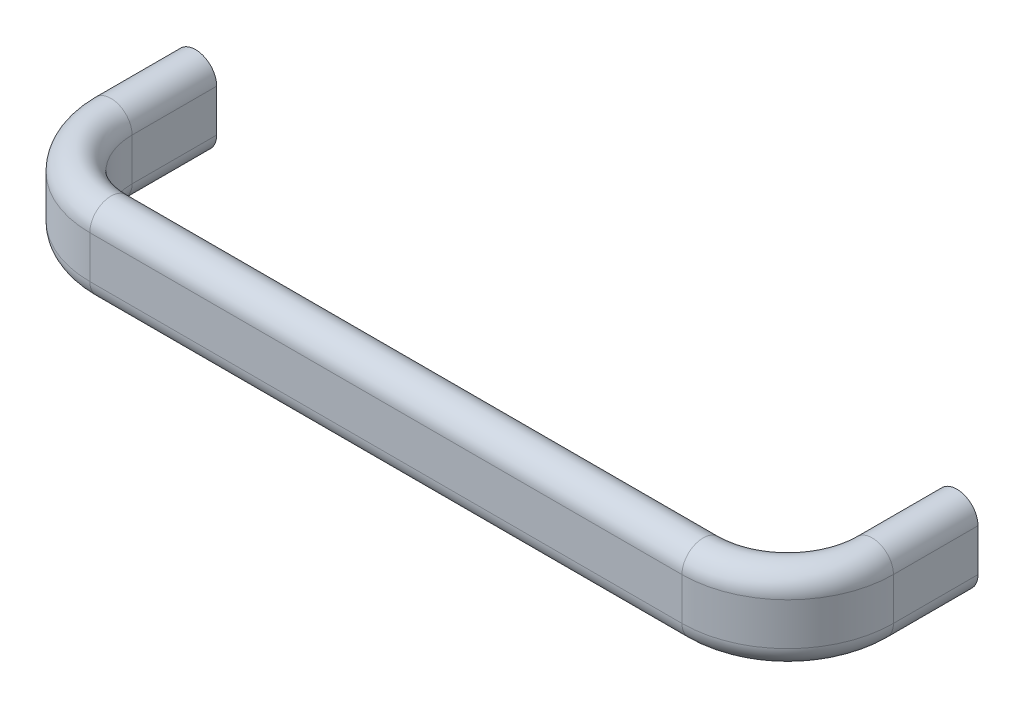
ISO-10303-21;
HEADER;
FILE_DESCRIPTION(('STEP AP214'),'2;1');
FILE_NAME('part.step','',(''),(''),'','','');
FILE_SCHEMA(('AUTOMOTIVE_DESIGN { 1 0 10303 214 1 1 1 1 }'));
ENDSEC;
DATA;
#1=APPLICATION_CONTEXT('core data for automotive mechanical design processes');
#2=APPLICATION_PROTOCOL_DEFINITION('international standard','automotive_design',2000,#1);
#3=PRODUCT_CONTEXT('',#1,'mechanical');
#4=PRODUCT('Part','Part','',(#3));
#5=PRODUCT_RELATED_PRODUCT_CATEGORY('part','',(#4));
#6=PRODUCT_DEFINITION_FORMATION('','',#4);
#7=PRODUCT_DEFINITION_CONTEXT('part definition',#1,'design');
#8=PRODUCT_DEFINITION('design','',#6,#7);
#9=PRODUCT_DEFINITION_SHAPE('','',#8);
#10=(LENGTH_UNIT() NAMED_UNIT(*) SI_UNIT(.MILLI.,.METRE.));
#11=(NAMED_UNIT(*) PLANE_ANGLE_UNIT() SI_UNIT($,.RADIAN.));
#12=(NAMED_UNIT(*) SI_UNIT($,.STERADIAN.) SOLID_ANGLE_UNIT());
#13=UNCERTAINTY_MEASURE_WITH_UNIT(LENGTH_MEASURE(1.E-05),#10,'distance_accuracy_value','');
#14=(GEOMETRIC_REPRESENTATION_CONTEXT(3) GLOBAL_UNCERTAINTY_ASSIGNED_CONTEXT((#13)) GLOBAL_UNIT_ASSIGNED_CONTEXT((#10,
#11,#12)) REPRESENTATION_CONTEXT('',''));
#15=CARTESIAN_POINT('',(0.,0.,0.));
#16=DIRECTION('',(0.,0.,1.));
#17=DIRECTION('',(1.,0.,0.));
#18=AXIS2_PLACEMENT_3D('',#15,#16,#17);
#19=CARTESIAN_POINT('',(-5.,-5.,20.));
#20=DIRECTION('',(-1.,0.,0.));
#21=DIRECTION('',(0.,-1.,0.));
#22=AXIS2_PLACEMENT_3D('',#19,#20,#21);
#23=PLANE('',#22);
#24=DIRECTION('',(0.,1.,0.));
#25=VECTOR('',#24,1.);
#26=CARTESIAN_POINT('',(-5.,-5.,20.));
#27=LINE('',#26,#25);
#28=CARTESIAN_POINT('',(-5.,-5.,20.));
#29=VERTEX_POINT('',#28);
#30=CARTESIAN_POINT('',(-5.,5.,20.));
#31=VERTEX_POINT('',#30);
#32=EDGE_CURVE('E200',#29,#31,#27,.T.);
#33=ORIENTED_EDGE('',*,*,#32,.T.);
#34=DIRECTION('',(0.,0.,-1.));
#35=VECTOR('',#34,1.);
#36=CARTESIAN_POINT('',(-5.,5.,20.));
#37=LINE('',#36,#35);
#38=CARTESIAN_POINT('',(-5.,5.,-1.77089470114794E-13));
#39=VERTEX_POINT('',#38);
#40=EDGE_CURVE('E224',#31,#39,#37,.T.);
#41=ORIENTED_EDGE('',*,*,#40,.T.);
#42=DIRECTION('',(0.,1.,0.));
#43=VECTOR('',#42,1.);
#44=CARTESIAN_POINT('',(-5.,-5.,-1.77089470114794E-13));
#45=LINE('',#44,#43);
#46=CARTESIAN_POINT('',(-5.,-5.,-1.77089470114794E-13));
#47=VERTEX_POINT('',#46);
#48=EDGE_CURVE('E222',#47,#39,#45,.T.);
#49=ORIENTED_EDGE('',*,*,#48,.F.);
#50=DIRECTION('',(0.,0.,-1.));
#51=VECTOR('',#50,1.);
#52=CARTESIAN_POINT('',(-5.,-5.,20.));
#53=LINE('',#52,#51);
#54=EDGE_CURVE('E227',#29,#47,#53,.T.);
#55=ORIENTED_EDGE('',*,*,#54,.F.);
#56=EDGE_LOOP('',(#33,#41,#49,#55));
#57=FACE_BOUND('',#56,.T.);
#58=ADVANCED_FACE('F14',(#57),#23,.T.);
#59=CARTESIAN_POINT('',(0.,5.,20.));
#60=DIRECTION('',(0.,0.,-1.));
#61=DIRECTION('',(0.,-1.,0.));
#62=AXIS2_PLACEMENT_3D('',#59,#60,#61);
#63=CYLINDRICAL_SURFACE('',#62,5.);
#64=CARTESIAN_POINT('',(0.,5.,20.));
#65=DIRECTION('',(0.,0.,-1.));
#66=DIRECTION('',(0.,1.,0.));
#67=AXIS2_PLACEMENT_3D('',#64,#65,#66);
#68=CIRCLE('',#67,5.);
#69=CARTESIAN_POINT('',(5.,5.,20.));
#70=VERTEX_POINT('',#69);
#71=EDGE_CURVE('E213',#31,#70,#68,.T.);
#72=ORIENTED_EDGE('',*,*,#71,.T.);
#73=DIRECTION('',(0.,0.,-1.));
#74=VECTOR('',#73,1.);
#75=CARTESIAN_POINT('',(5.,5.,20.));
#76=LINE('',#75,#74);
#77=CARTESIAN_POINT('',(5.,5.,-2.16878157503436E-13));
#78=VERTEX_POINT('',#77);
#79=EDGE_CURVE('E221',#70,#78,#76,.T.);
#80=ORIENTED_EDGE('',*,*,#79,.T.);
#81=CARTESIAN_POINT('',(0.,5.,-1.96983813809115E-13));
#82=DIRECTION('',(0.,0.,-1.));
#83=DIRECTION('',(0.,1.,0.));
#84=AXIS2_PLACEMENT_3D('',#81,#82,#83);
#85=CIRCLE('',#84,5.);
#86=EDGE_CURVE('E36',#39,#78,#85,.T.);
#87=ORIENTED_EDGE('',*,*,#86,.F.);
#88=ORIENTED_EDGE('',*,*,#40,.F.);
#89=EDGE_LOOP('',(#72,#80,#87,#88));
#90=FACE_BOUND('',#89,.T.);
#91=ADVANCED_FACE('F272',(#90),#63,.T.);
#92=CARTESIAN_POINT('',(5.,5.,20.));
#93=DIRECTION('',(1.,0.,0.));
#94=DIRECTION('',(0.,1.,0.));
#95=AXIS2_PLACEMENT_3D('',#92,#93,#94);
#96=PLANE('',#95);
#97=DIRECTION('',(0.,-1.,0.));
#98=VECTOR('',#97,1.);
#99=CARTESIAN_POINT('',(5.,5.,20.));
#100=LINE('',#99,#98);
#101=CARTESIAN_POINT('',(5.,-5.,20.));
#102=VERTEX_POINT('',#101);
#103=EDGE_CURVE('E210',#70,#102,#100,.T.);
#104=ORIENTED_EDGE('',*,*,#103,.T.);
#105=DIRECTION('',(0.,0.,-1.));
#106=VECTOR('',#105,1.);
#107=CARTESIAN_POINT('',(5.,-5.,20.));
#108=LINE('',#107,#106);
#109=CARTESIAN_POINT('',(5.,-5.,-2.16878157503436E-13));
#110=VERTEX_POINT('',#109);
#111=EDGE_CURVE('E218',#102,#110,#108,.T.);
#112=ORIENTED_EDGE('',*,*,#111,.T.);
#113=DIRECTION('',(0.,-1.,0.));
#114=VECTOR('',#113,1.);
#115=CARTESIAN_POINT('',(5.,5.,-2.16878157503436E-13));
#116=LINE('',#115,#114);
#117=EDGE_CURVE('E231',#78,#110,#116,.T.);
#118=ORIENTED_EDGE('',*,*,#117,.F.);
#119=ORIENTED_EDGE('',*,*,#79,.F.);
#120=EDGE_LOOP('',(#104,#112,#118,#119));
#121=FACE_BOUND('',#120,.T.);
#122=ADVANCED_FACE('F278',(#121),#96,.T.);
#123=CARTESIAN_POINT('',(0.,-5.,20.));
#124=DIRECTION('',(0.,0.,-1.));
#125=DIRECTION('',(0.,-1.,0.));
#126=AXIS2_PLACEMENT_3D('',#123,#124,#125);
#127=CYLINDRICAL_SURFACE('',#126,5.);
#128=CARTESIAN_POINT('',(0.,-5.,20.));
#129=DIRECTION('',(0.,0.,-1.));
#130=DIRECTION('',(0.,1.,0.));
#131=AXIS2_PLACEMENT_3D('',#128,#129,#130);
#132=CIRCLE('',#131,5.);
#133=EDGE_CURVE('E186',#102,#29,#132,.T.);
#134=ORIENTED_EDGE('',*,*,#133,.T.);
#135=ORIENTED_EDGE('',*,*,#54,.T.);
#136=CARTESIAN_POINT('',(0.,-5.,-1.96983813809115E-13));
#137=DIRECTION('',(0.,0.,-1.));
#138=DIRECTION('',(0.,1.,0.));
#139=AXIS2_PLACEMENT_3D('',#136,#137,#138);
#140=CIRCLE('',#139,5.);
#141=EDGE_CURVE('E28',#110,#47,#140,.T.);
#142=ORIENTED_EDGE('',*,*,#141,.F.);
#143=ORIENTED_EDGE('',*,*,#111,.F.);
#144=EDGE_LOOP('',(#134,#135,#142,#143));
#145=FACE_BOUND('',#144,.T.);
#146=ADVANCED_FACE('F297',(#145),#127,.T.);
#147=CARTESIAN_POINT('',(20.,0.,19.9999999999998));
#148=DIRECTION('',(0.,-1.,0.));
#149=DIRECTION('',(1.,0.,0.));
#150=AXIS2_PLACEMENT_3D('',#147,#148,#149);
#151=CYLINDRICAL_SURFACE('',#150,25.);
#152=DIRECTION('',(0.,1.,0.));
#153=VECTOR('',#152,1.);
#154=CARTESIAN_POINT('',(20.,-5.,45.));
#155=LINE('',#154,#153);
#156=CARTESIAN_POINT('',(20.,-5.,45.));
#157=VERTEX_POINT('',#156);
#158=CARTESIAN_POINT('',(20.,5.,45.));
#159=VERTEX_POINT('',#158);
#160=EDGE_CURVE('E177',#157,#159,#155,.T.);
#161=ORIENTED_EDGE('',*,*,#160,.T.);
#162=CARTESIAN_POINT('',(20.,5.,19.9999999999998));
#163=DIRECTION('',(0.,-1.,0.));
#164=DIRECTION('',(1.,0.,0.));
#165=AXIS2_PLACEMENT_3D('',#162,#163,#164);
#166=CIRCLE('',#165,25.);
#167=EDGE_CURVE('E203',#159,#31,#166,.T.);
#168=ORIENTED_EDGE('',*,*,#167,.T.);
#169=ORIENTED_EDGE('',*,*,#32,.F.);
#170=CARTESIAN_POINT('',(20.,-5.,19.9999999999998));
#171=DIRECTION('',(0.,-1.,0.));
#172=DIRECTION('',(1.,0.,0.));
#173=AXIS2_PLACEMENT_3D('',#170,#171,#172);
#174=CIRCLE('',#173,25.);
#175=EDGE_CURVE('E206',#157,#29,#174,.T.);
#176=ORIENTED_EDGE('',*,*,#175,.F.);
#177=EDGE_LOOP('',(#161,#168,#169,#176));
#178=FACE_BOUND('',#177,.T.);
#179=ADVANCED_FACE('F284',(#178),#151,.T.);
#180=CARTESIAN_POINT('',(20.,5.,19.9999999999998));
#181=DIRECTION('',(0.,-1.,0.));
#182=DIRECTION('',(1.,0.,0.));
#183=AXIS2_PLACEMENT_3D('',#180,#181,#182);
#184=TOROIDAL_SURFACE('',#183,20.,5.);
#185=CARTESIAN_POINT('',(20.,5.,40.));
#186=DIRECTION('',(-1.,0.,0.));
#187=DIRECTION('',(0.,1.,0.));
#188=AXIS2_PLACEMENT_3D('',#185,#186,#187);
#189=CIRCLE('',#188,5.);
#190=CARTESIAN_POINT('',(20.,5.,35.));
#191=VERTEX_POINT('',#190);
#192=EDGE_CURVE('E191',#159,#191,#189,.T.);
#193=ORIENTED_EDGE('',*,*,#192,.T.);
#194=CARTESIAN_POINT('',(20.,5.,19.9999999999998));
#195=DIRECTION('',(0.,-1.,0.));
#196=DIRECTION('',(1.,0.,0.));
#197=AXIS2_PLACEMENT_3D('',#194,#195,#196);
#198=CIRCLE('',#197,15.);
#199=EDGE_CURVE('E199',#191,#70,#198,.T.);
#200=ORIENTED_EDGE('',*,*,#199,.T.);
#201=ORIENTED_EDGE('',*,*,#71,.F.);
#202=ORIENTED_EDGE('',*,*,#167,.F.);
#203=EDGE_LOOP('',(#193,#200,#201,#202));
#204=FACE_BOUND('',#203,.T.);
#205=ADVANCED_FACE('F287',(#204),#184,.T.);
#206=CARTESIAN_POINT('',(20.,0.,19.9999999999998));
#207=DIRECTION('',(0.,-1.,0.));
#208=DIRECTION('',(1.,0.,0.));
#209=AXIS2_PLACEMENT_3D('',#206,#207,#208);
#210=CYLINDRICAL_SURFACE('',#209,15.);
#211=DIRECTION('',(0.,-1.,0.));
#212=VECTOR('',#211,1.);
#213=CARTESIAN_POINT('',(20.,5.,35.));
#214=LINE('',#213,#212);
#215=CARTESIAN_POINT('',(20.,-5.,35.));
#216=VERTEX_POINT('',#215);
#217=EDGE_CURVE('E188',#191,#216,#214,.T.);
#218=ORIENTED_EDGE('',*,*,#217,.T.);
#219=CARTESIAN_POINT('',(20.,-5.,19.9999999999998));
#220=DIRECTION('',(0.,-1.,0.));
#221=DIRECTION('',(1.,0.,0.));
#222=AXIS2_PLACEMENT_3D('',#219,#220,#221);
#223=CIRCLE('',#222,15.);
#224=EDGE_CURVE('E196',#216,#102,#223,.T.);
#225=ORIENTED_EDGE('',*,*,#224,.T.);
#226=ORIENTED_EDGE('',*,*,#103,.F.);
#227=ORIENTED_EDGE('',*,*,#199,.F.);
#228=EDGE_LOOP('',(#218,#225,#226,#227));
#229=FACE_BOUND('',#228,.T.);
#230=ADVANCED_FACE('F291',(#229),#210,.F.);
#231=CARTESIAN_POINT('',(20.,-5.,19.9999999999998));
#232=DIRECTION('',(0.,-1.,0.));
#233=DIRECTION('',(1.,0.,0.));
#234=AXIS2_PLACEMENT_3D('',#231,#232,#233);
#235=TOROIDAL_SURFACE('',#234,20.,5.);
#236=CARTESIAN_POINT('',(20.,-5.,40.));
#237=DIRECTION('',(-1.,0.,0.));
#238=DIRECTION('',(0.,1.,0.));
#239=AXIS2_PLACEMENT_3D('',#236,#237,#238);
#240=CIRCLE('',#239,5.);
#241=EDGE_CURVE('E163',#216,#157,#240,.T.);
#242=ORIENTED_EDGE('',*,*,#241,.T.);
#243=ORIENTED_EDGE('',*,*,#175,.T.);
#244=ORIENTED_EDGE('',*,*,#133,.F.);
#245=ORIENTED_EDGE('',*,*,#224,.F.);
#246=EDGE_LOOP('',(#242,#243,#244,#245));
#247=FACE_BOUND('',#246,.T.);
#248=ADVANCED_FACE('F295',(#247),#235,.T.);
#249=CARTESIAN_POINT('',(160.,-5.,45.));
#250=DIRECTION('',(0.,0.,1.));
#251=DIRECTION('',(1.,0.,0.));
#252=AXIS2_PLACEMENT_3D('',#249,#250,#251);
#253=PLANE('',#252);
#254=DIRECTION('',(0.,1.,0.));
#255=VECTOR('',#254,1.);
#256=CARTESIAN_POINT('',(160.,-5.,45.));
#257=LINE('',#256,#255);
#258=CARTESIAN_POINT('',(160.,-5.,45.));
#259=VERTEX_POINT('',#258);
#260=CARTESIAN_POINT('',(160.,5.,45.));
#261=VERTEX_POINT('',#260);
#262=EDGE_CURVE('E154',#259,#261,#257,.T.);
#263=ORIENTED_EDGE('',*,*,#262,.T.);
#264=DIRECTION('',(-1.,0.,0.));
#265=VECTOR('',#264,1.);
#266=CARTESIAN_POINT('',(160.,5.,45.));
#267=LINE('',#266,#265);
#268=EDGE_CURVE('E180',#261,#159,#267,.T.);
#269=ORIENTED_EDGE('',*,*,#268,.T.);
#270=ORIENTED_EDGE('',*,*,#160,.F.);
#271=DIRECTION('',(-1.,0.,0.));
#272=VECTOR('',#271,1.);
#273=CARTESIAN_POINT('',(160.,-5.,45.));
#274=LINE('',#273,#272);
#275=EDGE_CURVE('E183',#259,#157,#274,.T.);
#276=ORIENTED_EDGE('',*,*,#275,.F.);
#277=EDGE_LOOP('',(#263,#269,#270,#276));
#278=FACE_BOUND('',#277,.T.);
#279=ADVANCED_FACE('F353',(#278),#253,.T.);
#280=CARTESIAN_POINT('',(160.,5.,40.));
#281=DIRECTION('',(-1.,0.,0.));
#282=DIRECTION('',(0.,0.,1.));
#283=AXIS2_PLACEMENT_3D('',#280,#281,#282);
#284=CYLINDRICAL_SURFACE('',#283,5.);
#285=CARTESIAN_POINT('',(160.,5.,40.));
#286=DIRECTION('',(-1.,0.,0.));
#287=DIRECTION('',(0.,1.,0.));
#288=AXIS2_PLACEMENT_3D('',#285,#286,#287);
#289=CIRCLE('',#288,5.);
#290=CARTESIAN_POINT('',(160.,5.,34.9999999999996));
#291=VERTEX_POINT('',#290);
#292=EDGE_CURVE('E168',#261,#291,#289,.T.);
#293=ORIENTED_EDGE('',*,*,#292,.T.);
#294=DIRECTION('',(-1.,0.,0.));
#295=VECTOR('',#294,1.);
#296=CARTESIAN_POINT('',(160.,5.,34.9999999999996));
#297=LINE('',#296,#295);
#298=EDGE_CURVE('E176',#291,#191,#297,.T.);
#299=ORIENTED_EDGE('',*,*,#298,.T.);
#300=ORIENTED_EDGE('',*,*,#192,.F.);
#301=ORIENTED_EDGE('',*,*,#268,.F.);
#302=EDGE_LOOP('',(#293,#299,#300,#301));
#303=FACE_BOUND('',#302,.T.);
#304=ADVANCED_FACE('F349',(#303),#284,.T.);
#305=CARTESIAN_POINT('',(160.,5.,34.9999999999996));
#306=DIRECTION('',(0.,0.,-1.));
#307=DIRECTION('',(-1.,0.,0.));
#308=AXIS2_PLACEMENT_3D('',#305,#306,#307);
#309=PLANE('',#308);
#310=DIRECTION('',(0.,-1.,0.));
#311=VECTOR('',#310,1.);
#312=CARTESIAN_POINT('',(160.,5.,34.9999999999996));
#313=LINE('',#312,#311);
#314=CARTESIAN_POINT('',(160.,-5.,34.9999999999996));
#315=VERTEX_POINT('',#314);
#316=EDGE_CURVE('E165',#291,#315,#313,.T.);
#317=ORIENTED_EDGE('',*,*,#316,.T.);
#318=DIRECTION('',(-1.,0.,0.));
#319=VECTOR('',#318,1.);
#320=CARTESIAN_POINT('',(160.,-5.,34.9999999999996));
#321=LINE('',#320,#319);
#322=EDGE_CURVE('E173',#315,#216,#321,.T.);
#323=ORIENTED_EDGE('',*,*,#322,.T.);
#324=ORIENTED_EDGE('',*,*,#217,.F.);
#325=ORIENTED_EDGE('',*,*,#298,.F.);
#326=EDGE_LOOP('',(#317,#323,#324,#325));
#327=FACE_BOUND('',#326,.T.);
#328=ADVANCED_FACE('F345',(#327),#309,.T.);
#329=CARTESIAN_POINT('',(160.,-5.,40.));
#330=DIRECTION('',(-1.,0.,0.));
#331=DIRECTION('',(0.,0.,1.));
#332=AXIS2_PLACEMENT_3D('',#329,#330,#331);
#333=CYLINDRICAL_SURFACE('',#332,5.);
#334=CARTESIAN_POINT('',(160.,-5.,40.));
#335=DIRECTION('',(-1.,0.,0.));
#336=DIRECTION('',(0.,1.,0.));
#337=AXIS2_PLACEMENT_3D('',#334,#335,#336);
#338=CIRCLE('',#337,5.);
#339=EDGE_CURVE('E126',#315,#259,#338,.T.);
#340=ORIENTED_EDGE('',*,*,#339,.T.);
#341=ORIENTED_EDGE('',*,*,#275,.T.);
#342=ORIENTED_EDGE('',*,*,#241,.F.);
#343=ORIENTED_EDGE('',*,*,#322,.F.);
#344=EDGE_LOOP('',(#340,#341,#342,#343));
#345=FACE_BOUND('',#344,.T.);
#346=ADVANCED_FACE('F341',(#345),#333,.T.);
#347=CARTESIAN_POINT('',(160.,0.,19.9999999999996));
#348=DIRECTION('',(0.,-1.,0.));
#349=DIRECTION('',(1.,0.,0.));
#350=AXIS2_PLACEMENT_3D('',#347,#348,#349);
#351=CYLINDRICAL_SURFACE('',#350,25.);
#352=DIRECTION('',(0.,1.,0.));
#353=VECTOR('',#352,1.);
#354=CARTESIAN_POINT('',(185.,-5.,19.9999999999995));
#355=LINE('',#354,#353);
#356=CARTESIAN_POINT('',(185.,-5.,19.9999999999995));
#357=VERTEX_POINT('',#356);
#358=CARTESIAN_POINT('',(185.,5.,19.9999999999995));
#359=VERTEX_POINT('',#358);
#360=EDGE_CURVE('E125',#357,#359,#355,.T.);
#361=ORIENTED_EDGE('',*,*,#360,.T.);
#362=CARTESIAN_POINT('',(160.,5.,19.9999999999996));
#363=DIRECTION('',(0.,-1.,0.));
#364=DIRECTION('',(1.,0.,0.));
#365=AXIS2_PLACEMENT_3D('',#362,#363,#364);
#366=CIRCLE('',#365,25.);
#367=EDGE_CURVE('E157',#359,#261,#366,.T.);
#368=ORIENTED_EDGE('',*,*,#367,.T.);
#369=ORIENTED_EDGE('',*,*,#262,.F.);
#370=CARTESIAN_POINT('',(160.,-5.,19.9999999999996));
#371=DIRECTION('',(0.,-1.,0.));
#372=DIRECTION('',(1.,0.,0.));
#373=AXIS2_PLACEMENT_3D('',#370,#371,#372);
#374=CIRCLE('',#373,25.);
#375=EDGE_CURVE('E160',#357,#259,#374,.T.);
#376=ORIENTED_EDGE('',*,*,#375,.F.);
#377=EDGE_LOOP('',(#361,#368,#369,#376));
#378=FACE_BOUND('',#377,.T.);
#379=ADVANCED_FACE('F337',(#378),#351,.T.);
#380=CARTESIAN_POINT('',(160.,5.,19.9999999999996));
#381=DIRECTION('',(0.,-1.,0.));
#382=DIRECTION('',(1.,0.,0.));
#383=AXIS2_PLACEMENT_3D('',#380,#381,#382);
#384=TOROIDAL_SURFACE('',#383,20.,5.);
#385=CARTESIAN_POINT('',(180.,5.,19.9999999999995));
#386=DIRECTION('',(0.,0.,1.));
#387=DIRECTION('',(0.,1.,0.));
#388=AXIS2_PLACEMENT_3D('',#385,#386,#387);
#389=CIRCLE('',#388,5.);
#390=CARTESIAN_POINT('',(175.,5.,19.9999999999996));
#391=VERTEX_POINT('',#390);
#392=EDGE_CURVE('E140',#359,#391,#389,.T.);
#393=ORIENTED_EDGE('',*,*,#392,.T.);
#394=CARTESIAN_POINT('',(160.,5.,19.9999999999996));
#395=DIRECTION('',(0.,-1.,0.));
#396=DIRECTION('',(1.,0.,0.));
#397=AXIS2_PLACEMENT_3D('',#394,#395,#396);
#398=CIRCLE('',#397,15.);
#399=EDGE_CURVE('E153',#391,#291,#398,.T.);
#400=ORIENTED_EDGE('',*,*,#399,.T.);
#401=ORIENTED_EDGE('',*,*,#292,.F.);
#402=ORIENTED_EDGE('',*,*,#367,.F.);
#403=EDGE_LOOP('',(#393,#400,#401,#402));
#404=FACE_BOUND('',#403,.T.);
#405=ADVANCED_FACE('F333',(#404),#384,.T.);
#406=CARTESIAN_POINT('',(160.,0.,19.9999999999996));
#407=DIRECTION('',(0.,-1.,0.));
#408=DIRECTION('',(1.,0.,0.));
#409=AXIS2_PLACEMENT_3D('',#406,#407,#408);
#410=CYLINDRICAL_SURFACE('',#409,15.);
#411=DIRECTION('',(0.,-1.,0.));
#412=VECTOR('',#411,1.);
#413=CARTESIAN_POINT('',(175.,5.,19.9999999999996));
#414=LINE('',#413,#412);
#415=CARTESIAN_POINT('',(175.,-5.,19.9999999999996));
#416=VERTEX_POINT('',#415);
#417=EDGE_CURVE('E142',#391,#416,#414,.T.);
#418=ORIENTED_EDGE('',*,*,#417,.T.);
#419=CARTESIAN_POINT('',(160.,-5.,19.9999999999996));
#420=DIRECTION('',(0.,-1.,0.));
#421=DIRECTION('',(1.,0.,0.));
#422=AXIS2_PLACEMENT_3D('',#419,#420,#421);
#423=CIRCLE('',#422,15.);
#424=EDGE_CURVE('E150',#416,#315,#423,.T.);
#425=ORIENTED_EDGE('',*,*,#424,.T.);
#426=ORIENTED_EDGE('',*,*,#316,.F.);
#427=ORIENTED_EDGE('',*,*,#399,.F.);
#428=EDGE_LOOP('',(#418,#425,#426,#427));
#429=FACE_BOUND('',#428,.T.);
#430=ADVANCED_FACE('F329',(#429),#410,.F.);
#431=CARTESIAN_POINT('',(160.,-5.,19.9999999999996));
#432=DIRECTION('',(0.,-1.,0.));
#433=DIRECTION('',(1.,0.,0.));
#434=AXIS2_PLACEMENT_3D('',#431,#432,#433);
#435=TOROIDAL_SURFACE('',#434,20.,5.);
#436=CARTESIAN_POINT('',(180.,-5.,19.9999999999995));
#437=DIRECTION('',(0.,0.,1.));
#438=DIRECTION('',(0.,1.,0.));
#439=AXIS2_PLACEMENT_3D('',#436,#437,#438);
#440=CIRCLE('',#439,5.);
#441=EDGE_CURVE('E137',#416,#357,#440,.T.);
#442=ORIENTED_EDGE('',*,*,#441,.T.);
#443=ORIENTED_EDGE('',*,*,#375,.T.);
#444=ORIENTED_EDGE('',*,*,#339,.F.);
#445=ORIENTED_EDGE('',*,*,#424,.F.);
#446=EDGE_LOOP('',(#442,#443,#444,#445));
#447=FACE_BOUND('',#446,.T.);
#448=ADVANCED_FACE('F326',(#447),#435,.T.);
#449=CARTESIAN_POINT('',(180.,-5.,19.9999999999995));
#450=DIRECTION('',(0.,0.,-1.));
#451=DIRECTION('',(-1.,0.,0.));
#452=AXIS2_PLACEMENT_3D('',#449,#450,#451);
#453=CYLINDRICAL_SURFACE('',#452,5.);
#454=DIRECTION('',(0.,0.,-1.));
#455=VECTOR('',#454,1.);
#456=CARTESIAN_POINT('',(185.,-5.,19.9999999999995));
#457=LINE('',#456,#455);
#458=CARTESIAN_POINT('',(185.,-5.,-4.33474169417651E-13));
#459=VERTEX_POINT('',#458);
#460=EDGE_CURVE('E108',#357,#459,#457,.T.);
#461=ORIENTED_EDGE('',*,*,#460,.F.);
#462=ORIENTED_EDGE('',*,*,#441,.F.);
#463=DIRECTION('',(0.,0.,-1.));
#464=VECTOR('',#463,1.);
#465=CARTESIAN_POINT('',(175.,-5.,19.9999999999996));
#466=LINE('',#465,#464);
#467=CARTESIAN_POINT('',(175.,-5.,-4.21441057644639E-13));
#468=VERTEX_POINT('',#467);
#469=EDGE_CURVE('E111',#416,#468,#466,.T.);
#470=ORIENTED_EDGE('',*,*,#469,.T.);
#471=CARTESIAN_POINT('',(180.,-5.,-4.27457613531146E-13));
#472=DIRECTION('',(0.,0.,1.));
#473=DIRECTION('',(0.,1.,0.));
#474=AXIS2_PLACEMENT_3D('',#471,#472,#473);
#475=CIRCLE('',#474,5.);
#476=EDGE_CURVE('E104',#468,#459,#475,.T.);
#477=ORIENTED_EDGE('',*,*,#476,.T.);
#478=EDGE_LOOP('',(#461,#462,#470,#477));
#479=FACE_BOUND('',#478,.T.);
#480=ADVANCED_FACE('F106',(#479),#453,.T.);
#481=CARTESIAN_POINT('',(185.,-5.,19.9999999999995));
#482=DIRECTION('',(-1.,0.,0.));
#483=DIRECTION('',(0.,0.,1.));
#484=AXIS2_PLACEMENT_3D('',#481,#482,#483);
#485=PLANE('',#484);
#486=DIRECTION('',(0.,0.,-1.));
#487=VECTOR('',#486,1.);
#488=CARTESIAN_POINT('',(185.,5.,19.9999999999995));
#489=LINE('',#488,#487);
#490=CARTESIAN_POINT('',(185.,5.,-4.33474169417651E-13));
#491=VERTEX_POINT('',#490);
#492=EDGE_CURVE('E127',#359,#491,#489,.T.);
#493=ORIENTED_EDGE('',*,*,#492,.F.);
#494=ORIENTED_EDGE('',*,*,#360,.F.);
#495=ORIENTED_EDGE('',*,*,#460,.T.);
#496=DIRECTION('',(0.,1.,0.));
#497=VECTOR('',#496,1.);
#498=CARTESIAN_POINT('',(185.,-5.,-4.33474169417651E-13));
#499=LINE('',#498,#497);
#500=EDGE_CURVE('E116',#459,#491,#499,.T.);
#501=ORIENTED_EDGE('',*,*,#500,.T.);
#502=EDGE_LOOP('',(#493,#494,#495,#501));
#503=FACE_BOUND('',#502,.T.);
#504=ADVANCED_FACE('F122',(#503),#485,.F.);
#505=CARTESIAN_POINT('',(180.,5.,19.9999999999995));
#506=DIRECTION('',(0.,0.,-1.));
#507=DIRECTION('',(-1.,0.,0.));
#508=AXIS2_PLACEMENT_3D('',#505,#506,#507);
#509=CYLINDRICAL_SURFACE('',#508,5.);
#510=DIRECTION('',(0.,0.,-1.));
#511=VECTOR('',#510,1.);
#512=CARTESIAN_POINT('',(175.,5.,19.9999999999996));
#513=LINE('',#512,#511);
#514=CARTESIAN_POINT('',(175.,5.,-4.21441057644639E-13));
#515=VERTEX_POINT('',#514);
#516=EDGE_CURVE('E146',#391,#515,#513,.T.);
#517=ORIENTED_EDGE('',*,*,#516,.F.);
#518=ORIENTED_EDGE('',*,*,#392,.F.);
#519=ORIENTED_EDGE('',*,*,#492,.T.);
#520=CARTESIAN_POINT('',(180.,5.,-4.27457613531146E-13));
#521=DIRECTION('',(0.,0.,1.));
#522=DIRECTION('',(0.,1.,0.));
#523=AXIS2_PLACEMENT_3D('',#520,#521,#522);
#524=CIRCLE('',#523,5.);
#525=EDGE_CURVE('E130',#491,#515,#524,.T.);
#526=ORIENTED_EDGE('',*,*,#525,.T.);
#527=EDGE_LOOP('',(#517,#518,#519,#526));
#528=FACE_BOUND('',#527,.T.);
#529=ADVANCED_FACE('F303',(#528),#509,.T.);
#530=CARTESIAN_POINT('',(175.,5.,19.9999999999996));
#531=DIRECTION('',(1.,0.,0.));
#532=DIRECTION('',(0.,0.,-1.));
#533=AXIS2_PLACEMENT_3D('',#530,#531,#532);
#534=PLANE('',#533);
#535=ORIENTED_EDGE('',*,*,#417,.F.);
#536=ORIENTED_EDGE('',*,*,#516,.T.);
#537=DIRECTION('',(0.,-1.,0.));
#538=VECTOR('',#537,1.);
#539=CARTESIAN_POINT('',(175.,5.,-4.21441057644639E-13));
#540=LINE('',#539,#538);
#541=EDGE_CURVE('E132',#515,#468,#540,.T.);
#542=ORIENTED_EDGE('',*,*,#541,.T.);
#543=ORIENTED_EDGE('',*,*,#469,.F.);
#544=EDGE_LOOP('',(#535,#536,#542,#543));
#545=FACE_BOUND('',#544,.T.);
#546=ADVANCED_FACE('F300',(#545),#534,.F.);
#547=CARTESIAN_POINT('',(0.,-5.,-1.96983813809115E-13));
#548=DIRECTION('',(0.,0.,-1.));
#549=DIRECTION('',(0.,1.,0.));
#550=AXIS2_PLACEMENT_3D('',#547,#548,#549);
#551=PLANE('',#550);
#552=CARTESIAN_POINT('',(0.,0.,-1.93514366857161E-13));
#553=DIRECTION('',(0.,0.,-1.));
#554=DIRECTION('',(-1.,0.,0.));
#555=AXIS2_PLACEMENT_3D('',#552,#553,#554);
#556=CIRCLE('',#555,2.96700000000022);
#557=CARTESIAN_POINT('',(-2.96700000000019,0.,-1.91718864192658E-13));
#558=VERTEX_POINT('',#557);
#559=EDGE_CURVE('E249',#558,#558,#556,.T.);
#560=ORIENTED_EDGE('',*,*,#559,.F.);
#561=EDGE_LOOP('',(#560));
#562=FACE_BOUND('',#561,.T.);
#563=ORIENTED_EDGE('',*,*,#141,.T.);
#564=ORIENTED_EDGE('',*,*,#48,.T.);
#565=ORIENTED_EDGE('',*,*,#86,.T.);
#566=ORIENTED_EDGE('',*,*,#117,.T.);
#567=EDGE_LOOP('',(#563,#564,#565,#566));
#568=FACE_BOUND('',#567,.T.);
#569=ADVANCED_FACE('F298',(#562,#568),#551,.T.);
#570=CARTESIAN_POINT('',(180.,-5.,-4.27457613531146E-13));
#571=DIRECTION('',(0.,0.,1.));
#572=DIRECTION('',(0.,1.,0.));
#573=AXIS2_PLACEMENT_3D('',#570,#571,#572);
#574=PLANE('',#573);
#575=CARTESIAN_POINT('',(180.,0.,-4.10110378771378E-13));
#576=DIRECTION('',(0.,0.,1.));
#577=DIRECTION('',(1.,0.,0.));
#578=AXIS2_PLACEMENT_3D('',#575,#576,#577);
#579=CIRCLE('',#578,2.96700000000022);
#580=CARTESIAN_POINT('',(182.967,0.,-4.1545532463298E-13));
#581=VERTEX_POINT('',#580);
#582=EDGE_CURVE('E117',#581,#581,#579,.T.);
#583=ORIENTED_EDGE('',*,*,#582,.T.);
#584=EDGE_LOOP('',(#583));
#585=FACE_BOUND('',#584,.T.);
#586=ORIENTED_EDGE('',*,*,#476,.F.);
#587=ORIENTED_EDGE('',*,*,#541,.F.);
#588=ORIENTED_EDGE('',*,*,#525,.F.);
#589=ORIENTED_EDGE('',*,*,#500,.F.);
#590=EDGE_LOOP('',(#586,#587,#588,#589));
#591=FACE_BOUND('',#590,.T.);
#592=ADVANCED_FACE('F129',(#585,#591),#574,.F.);
#593=CARTESIAN_POINT('',(180.,0.,0.466999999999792));
#594=DIRECTION('',(0.,0.,-1.));
#595=DIRECTION('',(-1.,0.,0.));
#596=AXIS2_PLACEMENT_3D('',#593,#594,#595);
#597=CONICAL_SURFACE('',#596,2.5,0.785398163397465);
#598=ORIENTED_EDGE('',*,*,#582,.F.);
#599=EDGE_LOOP('',(#598));
#600=FACE_BOUND('',#599,.T.);
#601=CARTESIAN_POINT('',(180.,0.,0.466999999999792));
#602=DIRECTION('',(0.,0.,1.));
#603=DIRECTION('',(1.,0.,0.));
#604=AXIS2_PLACEMENT_3D('',#601,#602,#603);
#605=CIRCLE('',#604,2.5);
#606=CARTESIAN_POINT('',(182.5,0.,0.466999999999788));
#607=VERTEX_POINT('',#606);
#608=EDGE_CURVE('E247',#607,#607,#605,.T.);
#609=ORIENTED_EDGE('',*,*,#608,.T.);
#610=EDGE_LOOP('',(#609));
#611=FACE_BOUND('',#610,.T.);
#612=ADVANCED_FACE('F243',(#600,#611),#597,.F.);
#613=CARTESIAN_POINT('',(180.,0.,15.6933830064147));
#614=DIRECTION('',(0.,0.,1.));
#615=DIRECTION('',(1.,0.,0.));
#616=AXIS2_PLACEMENT_3D('',#613,#614,#615);
#617=CYLINDRICAL_SURFACE('',#616,2.5);
#618=CARTESIAN_POINT('',(180.,0.,9.99999999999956));
#619=DIRECTION('',(0.,0.,-1.));
#620=DIRECTION('',(-1.,0.,0.));
#621=AXIS2_PLACEMENT_3D('',#618,#619,#620);
#622=CIRCLE('',#621,2.5);
#623=CARTESIAN_POINT('',(177.5,0.,9.99999999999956));
#624=VERTEX_POINT('',#623);
#625=EDGE_CURVE('E21',#624,#624,#622,.T.);
#626=ORIENTED_EDGE('',*,*,#625,.F.);
#627=EDGE_LOOP('',(#626));
#628=FACE_BOUND('',#627,.T.);
#629=ORIENTED_EDGE('',*,*,#608,.F.);
#630=EDGE_LOOP('',(#629));
#631=FACE_BOUND('',#630,.T.);
#632=ADVANCED_FACE('F239',(#628,#631),#617,.F.);
#633=CARTESIAN_POINT('',(0.,0.,0.467000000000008));
#634=DIRECTION('',(0.,0.,-1.));
#635=DIRECTION('',(1.,0.,0.));
#636=AXIS2_PLACEMENT_3D('',#633,#634,#635);
#637=CONICAL_SURFACE('',#636,2.5,0.785398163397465);
#638=ORIENTED_EDGE('',*,*,#559,.T.);
#639=EDGE_LOOP('',(#638));
#640=FACE_BOUND('',#639,.T.);
#641=CARTESIAN_POINT('',(0.,0.,0.467000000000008));
#642=DIRECTION('',(0.,0.,-1.));
#643=DIRECTION('',(-1.,0.,0.));
#644=AXIS2_PLACEMENT_3D('',#641,#642,#643);
#645=CIRCLE('',#644,2.5);
#646=CARTESIAN_POINT('',(-2.49999999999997,0.,0.46700000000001));
#647=VERTEX_POINT('',#646);
#648=EDGE_CURVE('E253',#647,#647,#645,.T.);
#649=ORIENTED_EDGE('',*,*,#648,.F.);
#650=EDGE_LOOP('',(#649));
#651=FACE_BOUND('',#650,.T.);
#652=ADVANCED_FACE('F242',(#640,#651),#637,.F.);
#653=CARTESIAN_POINT('',(0.,0.,15.6933830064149));
#654=DIRECTION('',(0.,0.,1.));
#655=DIRECTION('',(-1.,0.,0.));
#656=AXIS2_PLACEMENT_3D('',#653,#654,#655);
#657=CYLINDRICAL_SURFACE('',#656,2.5);
#658=CARTESIAN_POINT('',(0.,0.,9.99999999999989));
#659=DIRECTION('',(0.,0.,-1.));
#660=DIRECTION('',(-1.,0.,0.));
#661=AXIS2_PLACEMENT_3D('',#658,#659,#660);
#662=CIRCLE('',#661,2.5);
#663=CARTESIAN_POINT('',(-2.49999999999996,0.,9.9999999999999));
#664=VERTEX_POINT('',#663);
#665=EDGE_CURVE('E9',#664,#664,#662,.T.);
#666=ORIENTED_EDGE('',*,*,#665,.F.);
#667=EDGE_LOOP('',(#666));
#668=FACE_BOUND('',#667,.T.);
#669=ORIENTED_EDGE('',*,*,#648,.T.);
#670=EDGE_LOOP('',(#669));
#671=FACE_BOUND('',#670,.T.);
#672=ADVANCED_FACE('F259',(#668,#671),#657,.F.);
#673=CARTESIAN_POINT('',(180.,0.,9.99999999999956));
#674=DIRECTION('',(0.,0.,-1.));
#675=DIRECTION('',(-1.,0.,0.));
#676=AXIS2_PLACEMENT_3D('',#673,#674,#675);
#677=PLANE('',#676);
#678=ORIENTED_EDGE('',*,*,#625,.T.);
#679=EDGE_LOOP('',(#678));
#680=FACE_BOUND('',#679,.T.);
#681=ADVANCED_FACE('F237',(#680),#677,.T.);
#682=CARTESIAN_POINT('',(0.,0.,9.99999999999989));
#683=DIRECTION('',(0.,0.,-1.));
#684=DIRECTION('',(-1.,0.,0.));
#685=AXIS2_PLACEMENT_3D('',#682,#683,#684);
#686=PLANE('',#685);
#687=ORIENTED_EDGE('',*,*,#665,.T.);
#688=EDGE_LOOP('',(#687));
#689=FACE_BOUND('',#688,.T.);
#690=ADVANCED_FACE('F512',(#689),#686,.T.);
#691=CLOSED_SHELL('',(#58,#91,#122,#146,#179,#205,#230,#248,#279,#304,#328,#346,#379,#405,#430,
#448,#480,#504,#529,#546,#569,#592,#612,#632,#652,#672,#681,#690));
#692=MANIFOLD_SOLID_BREP('B1',#691);
#693=ADVANCED_BREP_SHAPE_REPRESENTATION('',(#18,#692),#14);
#694=SHAPE_DEFINITION_REPRESENTATION(#9,#693);
ENDSEC;
END-ISO-10303-21;
